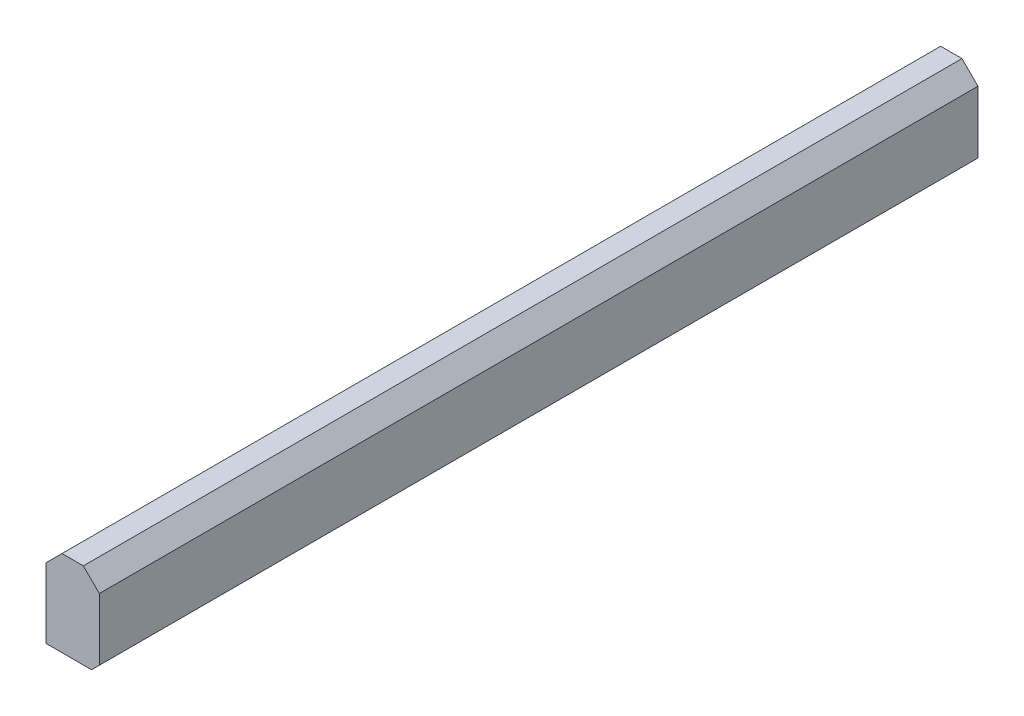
ISO-10303-21;
HEADER;
FILE_DESCRIPTION(('STEP AP214'),'2;1');
FILE_NAME('part.step','',(''),(''),'','','');
FILE_SCHEMA(('AUTOMOTIVE_DESIGN { 1 0 10303 214 1 1 1 1 }'));
ENDSEC;
DATA;
#1=APPLICATION_CONTEXT('core data for automotive mechanical design processes');
#2=APPLICATION_PROTOCOL_DEFINITION('international standard','automotive_design',2000,#1);
#3=PRODUCT_CONTEXT('',#1,'mechanical');
#4=PRODUCT('Part','Part','',(#3));
#5=PRODUCT_RELATED_PRODUCT_CATEGORY('part','',(#4));
#6=PRODUCT_DEFINITION_FORMATION('','',#4);
#7=PRODUCT_DEFINITION_CONTEXT('part definition',#1,'design');
#8=PRODUCT_DEFINITION('design','',#6,#7);
#9=PRODUCT_DEFINITION_SHAPE('','',#8);
#10=(LENGTH_UNIT() NAMED_UNIT(*) SI_UNIT(.MILLI.,.METRE.));
#11=(NAMED_UNIT(*) PLANE_ANGLE_UNIT() SI_UNIT($,.RADIAN.));
#12=(NAMED_UNIT(*) SI_UNIT($,.STERADIAN.) SOLID_ANGLE_UNIT());
#13=UNCERTAINTY_MEASURE_WITH_UNIT(LENGTH_MEASURE(1.E-05),#10,'distance_accuracy_value','');
#14=(GEOMETRIC_REPRESENTATION_CONTEXT(3) GLOBAL_UNCERTAINTY_ASSIGNED_CONTEXT((#13)) GLOBAL_UNIT_ASSIGNED_CONTEXT((#10,
#11,#12)) REPRESENTATION_CONTEXT('',''));
#15=CARTESIAN_POINT('',(0.,0.,0.));
#16=DIRECTION('',(0.,0.,1.));
#17=DIRECTION('',(1.,0.,0.));
#18=AXIS2_PLACEMENT_3D('',#15,#16,#17);
#19=CARTESIAN_POINT('',(-58.42,94.107,962.69097766));
#20=DIRECTION('',(0.,-1.,0.));
#21=DIRECTION('',(1.,0.,0.));
#22=AXIS2_PLACEMENT_3D('',#19,#20,#21);
#23=PLANE('',#22);
#24=DIRECTION('',(-1.,0.,0.));
#25=VECTOR('',#24,1.);
#26=CARTESIAN_POINT('',(-58.42,94.107,-962.69097766));
#27=LINE('',#26,#25);
#28=CARTESIAN_POINT('',(23.4200000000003,94.107,-962.69097766));
#29=VERTEX_POINT('',#28);
#30=CARTESIAN_POINT('',(-23.4200000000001,94.107,-962.69097766));
#31=VERTEX_POINT('',#30);
#32=EDGE_CURVE('E141',#29,#31,#27,.T.);
#33=ORIENTED_EDGE('',*,*,#32,.T.);
#34=DIRECTION('',(0.,0.,1.));
#35=VECTOR('',#34,1.);
#36=CARTESIAN_POINT('',(-23.4200000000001,94.107,962.69097766));
#37=LINE('',#36,#35);
#38=CARTESIAN_POINT('',(-23.4200000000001,94.107,962.69097766));
#39=VERTEX_POINT('',#38);
#40=EDGE_CURVE('E66',#31,#39,#37,.T.);
#41=ORIENTED_EDGE('',*,*,#40,.T.);
#42=DIRECTION('',(-1.,0.,0.));
#43=VECTOR('',#42,1.);
#44=CARTESIAN_POINT('',(-58.42,94.107,962.69097766));
#45=LINE('',#44,#43);
#46=CARTESIAN_POINT('',(23.4200000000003,94.107,962.69097766));
#47=VERTEX_POINT('',#46);
#48=EDGE_CURVE('E116',#47,#39,#45,.T.);
#49=ORIENTED_EDGE('',*,*,#48,.F.);
#50=DIRECTION('',(0.,0.,-1.));
#51=VECTOR('',#50,1.);
#52=CARTESIAN_POINT('',(23.4200000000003,94.107,962.69097766));
#53=LINE('',#52,#51);
#54=EDGE_CURVE('E175',#47,#29,#53,.T.);
#55=ORIENTED_EDGE('',*,*,#54,.T.);
#56=EDGE_LOOP('',(#33,#41,#49,#55));
#57=FACE_BOUND('',#56,.T.);
#58=ADVANCED_FACE('F46',(#57),#23,.F.);
#59=CARTESIAN_POINT('',(-58.42,-94.107,962.69097766));
#60=DIRECTION('',(1.,0.,0.));
#61=DIRECTION('',(0.,0.,-1.));
#62=AXIS2_PLACEMENT_3D('',#59,#60,#61);
#63=PLANE('',#62);
#64=DIRECTION('',(0.,-1.,0.));
#65=VECTOR('',#64,1.);
#66=CARTESIAN_POINT('',(-58.42,-94.107,962.69097766));
#67=LINE('',#66,#65);
#68=CARTESIAN_POINT('',(-58.42,59.1070000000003,962.69097766));
#69=VERTEX_POINT('',#68);
#70=CARTESIAN_POINT('',(-58.42,-94.107,962.69097766));
#71=VERTEX_POINT('',#70);
#72=EDGE_CURVE('E108',#69,#71,#67,.T.);
#73=ORIENTED_EDGE('',*,*,#72,.F.);
#74=DIRECTION('',(0.,0.,-1.));
#75=VECTOR('',#74,1.);
#76=CARTESIAN_POINT('',(-58.42,59.1070000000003,962.69097766));
#77=LINE('',#76,#75);
#78=CARTESIAN_POINT('',(-58.42,59.1070000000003,-962.69097766));
#79=VERTEX_POINT('',#78);
#80=EDGE_CURVE('E164',#69,#79,#77,.T.);
#81=ORIENTED_EDGE('',*,*,#80,.T.);
#82=DIRECTION('',(0.,-1.,0.));
#83=VECTOR('',#82,1.);
#84=CARTESIAN_POINT('',(-58.42,-94.107,-962.69097766));
#85=LINE('',#84,#83);
#86=CARTESIAN_POINT('',(-58.42,-94.107,-962.69097766));
#87=VERTEX_POINT('',#86);
#88=EDGE_CURVE('E127',#79,#87,#85,.T.);
#89=ORIENTED_EDGE('',*,*,#88,.T.);
#90=DIRECTION('',(0.,0.,-1.));
#91=VECTOR('',#90,1.);
#92=CARTESIAN_POINT('',(-58.42,-94.107,962.69097766));
#93=LINE('',#92,#91);
#94=EDGE_CURVE('E125',#71,#87,#93,.T.);
#95=ORIENTED_EDGE('',*,*,#94,.F.);
#96=EDGE_LOOP('',(#73,#81,#89,#95));
#97=FACE_BOUND('',#96,.T.);
#98=ADVANCED_FACE('F121',(#97),#63,.F.);
#99=CARTESIAN_POINT('',(-58.42,-94.107,962.69097766));
#100=DIRECTION('',(0.,1.,0.));
#101=DIRECTION('',(-1.,0.,0.));
#102=AXIS2_PLACEMENT_3D('',#99,#100,#101);
#103=PLANE('',#102);
#104=DIRECTION('',(1.,0.,0.));
#105=VECTOR('',#104,1.);
#106=CARTESIAN_POINT('',(-58.42,-94.107,-962.69097766));
#107=LINE('',#106,#105);
#108=CARTESIAN_POINT('',(41.4200000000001,-94.107,-962.69097766));
#109=VERTEX_POINT('',#108);
#110=EDGE_CURVE('E146',#87,#109,#107,.T.);
#111=ORIENTED_EDGE('',*,*,#110,.T.);
#112=DIRECTION('',(0.,0.,1.));
#113=VECTOR('',#112,1.);
#114=CARTESIAN_POINT('',(41.4200000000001,-94.107,962.69097766));
#115=LINE('',#114,#113);
#116=CARTESIAN_POINT('',(41.4200000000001,-94.107,962.69097766));
#117=VERTEX_POINT('',#116);
#118=EDGE_CURVE('E137',#109,#117,#115,.T.);
#119=ORIENTED_EDGE('',*,*,#118,.T.);
#120=DIRECTION('',(1.,0.,0.));
#121=VECTOR('',#120,1.);
#122=CARTESIAN_POINT('',(-58.42,-94.107,962.69097766));
#123=LINE('',#122,#121);
#124=EDGE_CURVE('E114',#71,#117,#123,.T.);
#125=ORIENTED_EDGE('',*,*,#124,.F.);
#126=ORIENTED_EDGE('',*,*,#94,.T.);
#127=EDGE_LOOP('',(#111,#119,#125,#126));
#128=FACE_BOUND('',#127,.T.);
#129=ADVANCED_FACE('F135',(#128),#103,.F.);
#130=CARTESIAN_POINT('',(58.42,-94.107,962.69097766));
#131=DIRECTION('',(-1.,0.,0.));
#132=DIRECTION('',(0.,0.,1.));
#133=AXIS2_PLACEMENT_3D('',#130,#131,#132);
#134=PLANE('',#133);
#135=DIRECTION('',(0.,1.,0.));
#136=VECTOR('',#135,1.);
#137=CARTESIAN_POINT('',(58.42,-94.107,-962.69097766));
#138=LINE('',#137,#136);
#139=CARTESIAN_POINT('',(58.42,-77.1070000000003,-962.69097766));
#140=VERTEX_POINT('',#139);
#141=CARTESIAN_POINT('',(58.42,59.1070000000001,-962.69097766));
#142=VERTEX_POINT('',#141);
#143=EDGE_CURVE('E151',#140,#142,#138,.T.);
#144=ORIENTED_EDGE('',*,*,#143,.T.);
#145=DIRECTION('',(0.,0.,1.));
#146=VECTOR('',#145,1.);
#147=CARTESIAN_POINT('',(58.42,59.1070000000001,962.69097766));
#148=LINE('',#147,#146);
#149=CARTESIAN_POINT('',(58.42,59.1070000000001,962.69097766));
#150=VERTEX_POINT('',#149);
#151=EDGE_CURVE('E11',#142,#150,#148,.T.);
#152=ORIENTED_EDGE('',*,*,#151,.T.);
#153=DIRECTION('',(0.,1.,0.));
#154=VECTOR('',#153,1.);
#155=CARTESIAN_POINT('',(58.42,-94.107,962.69097766));
#156=LINE('',#155,#154);
#157=CARTESIAN_POINT('',(58.42,-77.1070000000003,962.69097766));
#158=VERTEX_POINT('',#157);
#159=EDGE_CURVE('E134',#158,#150,#156,.T.);
#160=ORIENTED_EDGE('',*,*,#159,.F.);
#161=DIRECTION('',(0.,0.,-1.));
#162=VECTOR('',#161,1.);
#163=CARTESIAN_POINT('',(58.42,-77.1070000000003,962.69097766));
#164=LINE('',#163,#162);
#165=EDGE_CURVE('E133',#158,#140,#164,.T.);
#166=ORIENTED_EDGE('',*,*,#165,.T.);
#167=EDGE_LOOP('',(#144,#152,#160,#166));
#168=FACE_BOUND('',#167,.T.);
#169=ADVANCED_FACE('F192',(#168),#134,.F.);
#170=CARTESIAN_POINT('',(0.,0.,962.69097766));
#171=DIRECTION('',(0.,0.,1.));
#172=DIRECTION('',(1.,0.,0.));
#173=AXIS2_PLACEMENT_3D('',#170,#171,#172);
#174=PLANE('',#173);
#175=ORIENTED_EDGE('',*,*,#48,.T.);
#176=DIRECTION('',(0.70710678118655,0.707106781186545,0.));
#177=VECTOR('',#176,1.);
#178=CARTESIAN_POINT('',(-58.7635,58.7635000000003,962.69097766));
#179=LINE('',#178,#177);
#180=EDGE_CURVE('E57',#39,#69,#179,.F.);
#181=ORIENTED_EDGE('',*,*,#180,.T.);
#182=ORIENTED_EDGE('',*,*,#72,.T.);
#183=ORIENTED_EDGE('',*,*,#124,.T.);
#184=DIRECTION('',(-0.707106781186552,-0.707106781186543,0.));
#185=VECTOR('',#184,1.);
#186=CARTESIAN_POINT('',(67.7634999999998,-67.7635000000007,962.69097766));
#187=LINE('',#186,#185);
#188=EDGE_CURVE('E165',#117,#158,#187,.F.);
#189=ORIENTED_EDGE('',*,*,#188,.T.);
#190=ORIENTED_EDGE('',*,*,#159,.T.);
#191=DIRECTION('',(0.707106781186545,-0.70710678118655,0.));
#192=VECTOR('',#191,1.);
#193=CARTESIAN_POINT('',(58.7635000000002,58.7634999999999,962.69097766));
#194=LINE('',#193,#192);
#195=EDGE_CURVE('E178',#150,#47,#194,.F.);
#196=ORIENTED_EDGE('',*,*,#195,.T.);
#197=EDGE_LOOP('',(#175,#181,#182,#183,#189,#190,#196));
#198=FACE_BOUND('',#197,.T.);
#199=ADVANCED_FACE('F112',(#198),#174,.T.);
#200=CARTESIAN_POINT('',(0.,0.,-962.69097766));
#201=DIRECTION('',(0.,0.,1.));
#202=DIRECTION('',(1.,0.,0.));
#203=AXIS2_PLACEMENT_3D('',#200,#201,#202);
#204=PLANE('',#203);
#205=ORIENTED_EDGE('',*,*,#88,.F.);
#206=DIRECTION('',(-0.70710678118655,-0.707106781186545,0.));
#207=VECTOR('',#206,1.);
#208=CARTESIAN_POINT('',(-58.42,59.1070000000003,-962.69097766));
#209=LINE('',#208,#207);
#210=EDGE_CURVE('E173',#79,#31,#209,.F.);
#211=ORIENTED_EDGE('',*,*,#210,.T.);
#212=ORIENTED_EDGE('',*,*,#32,.F.);
#213=DIRECTION('',(-0.707106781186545,0.70710678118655,0.));
#214=VECTOR('',#213,1.);
#215=CARTESIAN_POINT('',(23.4200000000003,94.107,-962.69097766));
#216=LINE('',#215,#214);
#217=EDGE_CURVE('E169',#29,#142,#216,.F.);
#218=ORIENTED_EDGE('',*,*,#217,.T.);
#219=ORIENTED_EDGE('',*,*,#143,.F.);
#220=DIRECTION('',(0.707106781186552,0.707106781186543,0.));
#221=VECTOR('',#220,1.);
#222=CARTESIAN_POINT('',(58.42,-77.1070000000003,-962.69097766));
#223=LINE('',#222,#221);
#224=EDGE_CURVE('E160',#140,#109,#223,.F.);
#225=ORIENTED_EDGE('',*,*,#224,.T.);
#226=ORIENTED_EDGE('',*,*,#110,.F.);
#227=EDGE_LOOP('',(#205,#211,#212,#218,#219,#225,#226));
#228=FACE_BOUND('',#227,.T.);
#229=ADVANCED_FACE('F186',(#228),#204,.F.);
#230=CARTESIAN_POINT('',(58.42,-77.1070000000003,962.69097766));
#231=DIRECTION('',(-0.707106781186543,0.707106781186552,0.));
#232=DIRECTION('',(0.,0.,-1.));
#233=AXIS2_PLACEMENT_3D('',#230,#231,#232);
#234=PLANE('',#233);
#235=ORIENTED_EDGE('',*,*,#188,.F.);
#236=ORIENTED_EDGE('',*,*,#118,.F.);
#237=ORIENTED_EDGE('',*,*,#224,.F.);
#238=ORIENTED_EDGE('',*,*,#165,.F.);
#239=EDGE_LOOP('',(#235,#236,#237,#238));
#240=FACE_BOUND('',#239,.T.);
#241=ADVANCED_FACE('F191',(#240),#234,.F.);
#242=CARTESIAN_POINT('',(-58.42,59.1070000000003,962.69097766));
#243=DIRECTION('',(0.707106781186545,-0.70710678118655,0.));
#244=DIRECTION('',(0.,0.,-1.));
#245=AXIS2_PLACEMENT_3D('',#242,#243,#244);
#246=PLANE('',#245);
#247=ORIENTED_EDGE('',*,*,#180,.F.);
#248=ORIENTED_EDGE('',*,*,#40,.F.);
#249=ORIENTED_EDGE('',*,*,#210,.F.);
#250=ORIENTED_EDGE('',*,*,#80,.F.);
#251=EDGE_LOOP('',(#247,#248,#249,#250));
#252=FACE_BOUND('',#251,.T.);
#253=ADVANCED_FACE('F198',(#252),#246,.F.);
#254=CARTESIAN_POINT('',(23.4200000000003,94.107,962.69097766));
#255=DIRECTION('',(-0.70710678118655,-0.707106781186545,0.));
#256=DIRECTION('',(0.,0.,-1.));
#257=AXIS2_PLACEMENT_3D('',#254,#255,#256);
#258=PLANE('',#257);
#259=ORIENTED_EDGE('',*,*,#195,.F.);
#260=ORIENTED_EDGE('',*,*,#151,.F.);
#261=ORIENTED_EDGE('',*,*,#217,.F.);
#262=ORIENTED_EDGE('',*,*,#54,.F.);
#263=EDGE_LOOP('',(#259,#260,#261,#262));
#264=FACE_BOUND('',#263,.T.);
#265=ADVANCED_FACE('F47',(#264),#258,.F.);
#266=CLOSED_SHELL('',(#58,#98,#129,#169,#199,#229,#241,#253,#265));
#267=MANIFOLD_SOLID_BREP('B2',#266);
#268=ADVANCED_BREP_SHAPE_REPRESENTATION('',(#18,#267),#14);
#269=SHAPE_DEFINITION_REPRESENTATION(#9,#268);
ENDSEC;
END-ISO-10303-21;
